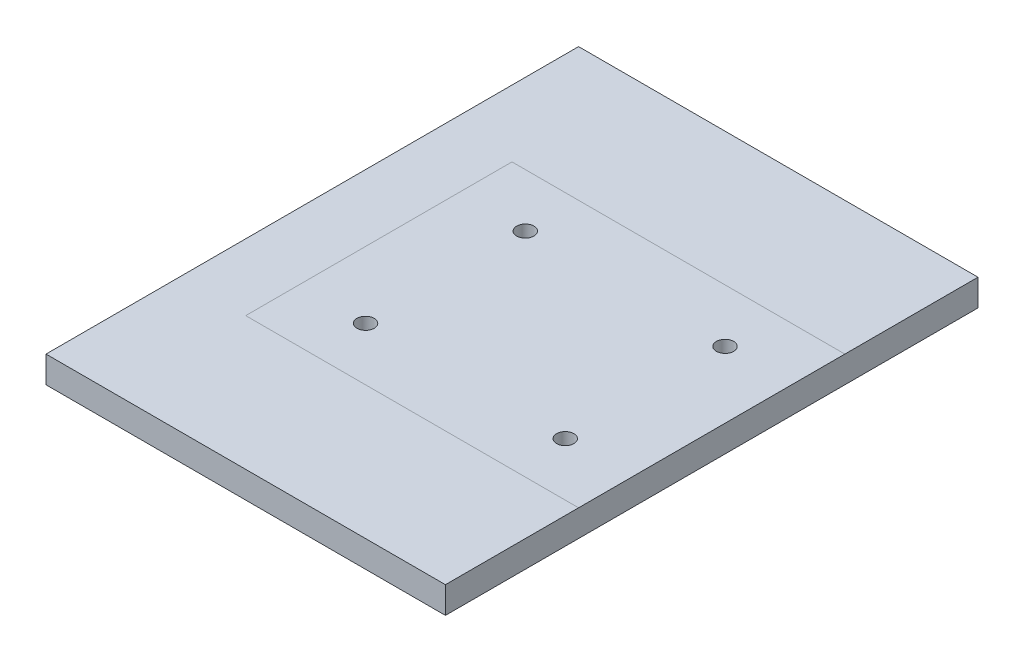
ISO-10303-21;
HEADER;
FILE_DESCRIPTION(('STEP AP214'),'2;1');
FILE_NAME('part.step','',(''),(''),'','','');
FILE_SCHEMA(('AUTOMOTIVE_DESIGN { 1 0 10303 214 1 1 1 1 }'));
ENDSEC;
DATA;
#1=APPLICATION_CONTEXT('core data for automotive mechanical design processes');
#2=APPLICATION_PROTOCOL_DEFINITION('international standard','automotive_design',2000,#1);
#3=PRODUCT_CONTEXT('',#1,'mechanical');
#4=PRODUCT('Part','Part','',(#3));
#5=PRODUCT_RELATED_PRODUCT_CATEGORY('part','',(#4));
#6=PRODUCT_DEFINITION_FORMATION('','',#4);
#7=PRODUCT_DEFINITION_CONTEXT('part definition',#1,'design');
#8=PRODUCT_DEFINITION('design','',#6,#7);
#9=PRODUCT_DEFINITION_SHAPE('','',#8);
#10=(LENGTH_UNIT() NAMED_UNIT(*) SI_UNIT(.MILLI.,.METRE.));
#11=(NAMED_UNIT(*) PLANE_ANGLE_UNIT() SI_UNIT($,.RADIAN.));
#12=(NAMED_UNIT(*) SI_UNIT($,.STERADIAN.) SOLID_ANGLE_UNIT());
#13=UNCERTAINTY_MEASURE_WITH_UNIT(LENGTH_MEASURE(1.E-05),#10,'distance_accuracy_value','');
#14=(GEOMETRIC_REPRESENTATION_CONTEXT(3) GLOBAL_UNCERTAINTY_ASSIGNED_CONTEXT((#13)) GLOBAL_UNIT_ASSIGNED_CONTEXT((#10,
#11,#12)) REPRESENTATION_CONTEXT('',''));
#15=CARTESIAN_POINT('',(0.,0.,0.));
#16=DIRECTION('',(0.,0.,1.));
#17=DIRECTION('',(1.,0.,0.));
#18=AXIS2_PLACEMENT_3D('',#15,#16,#17);
#19=CARTESIAN_POINT('',(-150.,-20.,200.));
#20=DIRECTION('',(0.,1.,0.));
#21=DIRECTION('',(0.,0.,1.));
#22=AXIS2_PLACEMENT_3D('',#19,#20,#21);
#23=PLANE('',#22);
#24=CARTESIAN_POINT('',(-50.,-20.,-60.));
#25=DIRECTION('',(0.,1.,0.));
#26=DIRECTION('',(0.,0.,1.));
#27=AXIS2_PLACEMENT_3D('',#24,#25,#26);
#28=CIRCLE('',#27,14.);
#29=CARTESIAN_POINT('',(-50.,-20.,-46.));
#30=VERTEX_POINT('',#29);
#31=EDGE_CURVE('E42',#30,#30,#28,.F.);
#32=ORIENTED_EDGE('',*,*,#31,.F.);
#33=EDGE_LOOP('',(#32));
#34=FACE_BOUND('',#33,.T.);
#35=CARTESIAN_POINT('',(-50.,-20.,60.));
#36=DIRECTION('',(0.,1.,0.));
#37=DIRECTION('',(0.,0.,1.));
#38=AXIS2_PLACEMENT_3D('',#35,#36,#37);
#39=CIRCLE('',#38,14.);
#40=CARTESIAN_POINT('',(-50.,-20.,74.));
#41=VERTEX_POINT('',#40);
#42=EDGE_CURVE('E141',#41,#41,#39,.F.);
#43=ORIENTED_EDGE('',*,*,#42,.F.);
#44=EDGE_LOOP('',(#43));
#45=FACE_BOUND('',#44,.T.);
#46=DIRECTION('',(0.,0.,1.));
#47=VECTOR('',#46,1.);
#48=CARTESIAN_POINT('',(-150.,-20.,-200.));
#49=LINE('',#48,#47);
#50=CARTESIAN_POINT('',(-150.,-20.,-200.));
#51=VERTEX_POINT('',#50);
#52=CARTESIAN_POINT('',(-150.,-20.,200.));
#53=VERTEX_POINT('',#52);
#54=EDGE_CURVE('E91',#51,#53,#49,.T.);
#55=ORIENTED_EDGE('',*,*,#54,.F.);
#56=DIRECTION('',(-1.,0.,0.));
#57=VECTOR('',#56,1.);
#58=CARTESIAN_POINT('',(-150.,-20.,-200.));
#59=LINE('',#58,#57);
#60=CARTESIAN_POINT('',(150.,-20.,-200.));
#61=VERTEX_POINT('',#60);
#62=EDGE_CURVE('E96',#61,#51,#59,.T.);
#63=ORIENTED_EDGE('',*,*,#62,.F.);
#64=DIRECTION('',(0.,0.,-1.));
#65=VECTOR('',#64,1.);
#66=CARTESIAN_POINT('',(150.,-20.,-200.));
#67=LINE('',#66,#65);
#68=CARTESIAN_POINT('',(150.,-20.,200.));
#69=VERTEX_POINT('',#68);
#70=EDGE_CURVE('E123',#69,#61,#67,.T.);
#71=ORIENTED_EDGE('',*,*,#70,.F.);
#72=DIRECTION('',(1.,0.,0.));
#73=VECTOR('',#72,1.);
#74=CARTESIAN_POINT('',(-150.,-20.,200.));
#75=LINE('',#74,#73);
#76=EDGE_CURVE('E121',#53,#69,#75,.T.);
#77=ORIENTED_EDGE('',*,*,#76,.F.);
#78=EDGE_LOOP('',(#55,#63,#71,#77));
#79=FACE_BOUND('',#78,.T.);
#80=CARTESIAN_POINT('',(100.,-20.,60.));
#81=DIRECTION('',(0.,1.,0.));
#82=DIRECTION('',(0.,0.,1.));
#83=AXIS2_PLACEMENT_3D('',#80,#81,#82);
#84=CIRCLE('',#83,14.);
#85=CARTESIAN_POINT('',(100.,-20.,74.));
#86=VERTEX_POINT('',#85);
#87=EDGE_CURVE('E145',#86,#86,#84,.F.);
#88=ORIENTED_EDGE('',*,*,#87,.F.);
#89=EDGE_LOOP('',(#88));
#90=FACE_BOUND('',#89,.T.);
#91=CARTESIAN_POINT('',(100.,-20.,-60.));
#92=DIRECTION('',(0.,1.,0.));
#93=DIRECTION('',(0.,0.,1.));
#94=AXIS2_PLACEMENT_3D('',#91,#92,#93);
#95=CIRCLE('',#94,14.);
#96=CARTESIAN_POINT('',(100.,-20.,-46.));
#97=VERTEX_POINT('',#96);
#98=EDGE_CURVE('E11',#97,#97,#95,.F.);
#99=ORIENTED_EDGE('',*,*,#98,.F.);
#100=EDGE_LOOP('',(#99));
#101=FACE_BOUND('',#100,.T.);
#102=ADVANCED_FACE('F33',(#34,#45,#79,#90,#101),#23,.F.);
#103=ORIENTED_EDGE('',*,*,#98,.T.);
#104=EDGE_LOOP('',(#103));
#105=FACE_BOUND('',#104,.T.);
#106=CARTESIAN_POINT('',(100.,-20.,-60.));
#107=DIRECTION('',(0.,1.,0.));
#108=DIRECTION('',(0.,0.,1.));
#109=AXIS2_PLACEMENT_3D('',#106,#107,#108);
#110=CIRCLE('',#109,6.5);
#111=CARTESIAN_POINT('',(100.,-20.,-53.5));
#112=VERTEX_POINT('',#111);
#113=EDGE_CURVE('E109',#112,#112,#110,.T.);
#114=ORIENTED_EDGE('',*,*,#113,.T.);
#115=EDGE_LOOP('',(#114));
#116=FACE_BOUND('',#115,.T.);
#117=ADVANCED_FACE('F159',(#105,#116),#23,.F.);
#118=ORIENTED_EDGE('',*,*,#31,.T.);
#119=EDGE_LOOP('',(#118));
#120=FACE_BOUND('',#119,.T.);
#121=CARTESIAN_POINT('',(-50.,-20.,-60.));
#122=DIRECTION('',(0.,1.,0.));
#123=DIRECTION('',(0.,0.,1.));
#124=AXIS2_PLACEMENT_3D('',#121,#122,#123);
#125=CIRCLE('',#124,6.5);
#126=CARTESIAN_POINT('',(-50.,-20.,-53.5));
#127=VERTEX_POINT('',#126);
#128=EDGE_CURVE('E183',#127,#127,#125,.T.);
#129=ORIENTED_EDGE('',*,*,#128,.T.);
#130=EDGE_LOOP('',(#129));
#131=FACE_BOUND('',#130,.T.);
#132=ADVANCED_FACE('F154',(#120,#131),#23,.F.);
#133=ORIENTED_EDGE('',*,*,#87,.T.);
#134=EDGE_LOOP('',(#133));
#135=FACE_BOUND('',#134,.T.);
#136=CARTESIAN_POINT('',(100.,-20.,60.));
#137=DIRECTION('',(0.,1.,0.));
#138=DIRECTION('',(0.,0.,1.));
#139=AXIS2_PLACEMENT_3D('',#136,#137,#138);
#140=CIRCLE('',#139,6.5);
#141=CARTESIAN_POINT('',(100.,-20.,66.5));
#142=VERTEX_POINT('',#141);
#143=EDGE_CURVE('E196',#142,#142,#140,.T.);
#144=ORIENTED_EDGE('',*,*,#143,.T.);
#145=EDGE_LOOP('',(#144));
#146=FACE_BOUND('',#145,.T.);
#147=ADVANCED_FACE('F226',(#135,#146),#23,.F.);
#148=CARTESIAN_POINT('',(-150.,0.,200.));
#149=DIRECTION('',(0.,1.,0.));
#150=DIRECTION('',(0.,0.,1.));
#151=AXIS2_PLACEMENT_3D('',#148,#149,#150);
#152=PLANE('',#151);
#153=DIRECTION('',(0.,0.,-1.));
#154=VECTOR('',#153,1.);
#155=CARTESIAN_POINT('',(-99.9999999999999,0.,200.));
#156=LINE('',#155,#154);
#157=CARTESIAN_POINT('',(-99.9999999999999,0.,100.));
#158=VERTEX_POINT('',#157);
#159=CARTESIAN_POINT('',(-99.9999999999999,0.,-100.));
#160=VERTEX_POINT('',#159);
#161=EDGE_CURVE('E53',#158,#160,#156,.T.);
#162=ORIENTED_EDGE('',*,*,#161,.T.);
#163=DIRECTION('',(1.,0.,0.));
#164=VECTOR('',#163,1.);
#165=CARTESIAN_POINT('',(-150.,0.,-100.));
#166=LINE('',#165,#164);
#167=CARTESIAN_POINT('',(150.,0.,-100.));
#168=VERTEX_POINT('',#167);
#169=EDGE_CURVE('E49',#160,#168,#166,.T.);
#170=ORIENTED_EDGE('',*,*,#169,.T.);
#171=DIRECTION('',(0.,0.,-1.));
#172=VECTOR('',#171,1.);
#173=CARTESIAN_POINT('',(150.,0.,-200.));
#174=LINE('',#173,#172);
#175=CARTESIAN_POINT('',(150.,0.,-200.));
#176=VERTEX_POINT('',#175);
#177=EDGE_CURVE('E104',#168,#176,#174,.T.);
#178=ORIENTED_EDGE('',*,*,#177,.T.);
#179=DIRECTION('',(-1.,0.,0.));
#180=VECTOR('',#179,1.);
#181=CARTESIAN_POINT('',(-150.,0.,-200.));
#182=LINE('',#181,#180);
#183=CARTESIAN_POINT('',(-150.,0.,-200.));
#184=VERTEX_POINT('',#183);
#185=EDGE_CURVE('E108',#176,#184,#182,.T.);
#186=ORIENTED_EDGE('',*,*,#185,.T.);
#187=DIRECTION('',(0.,0.,1.));
#188=VECTOR('',#187,1.);
#189=CARTESIAN_POINT('',(-150.,0.,-200.));
#190=LINE('',#189,#188);
#191=CARTESIAN_POINT('',(-150.,0.,200.));
#192=VERTEX_POINT('',#191);
#193=EDGE_CURVE('E88',#184,#192,#190,.T.);
#194=ORIENTED_EDGE('',*,*,#193,.T.);
#195=DIRECTION('',(1.,0.,0.));
#196=VECTOR('',#195,1.);
#197=CARTESIAN_POINT('',(-150.,0.,200.));
#198=LINE('',#197,#196);
#199=CARTESIAN_POINT('',(150.,0.,200.));
#200=VERTEX_POINT('',#199);
#201=EDGE_CURVE('E99',#192,#200,#198,.T.);
#202=ORIENTED_EDGE('',*,*,#201,.T.);
#203=CARTESIAN_POINT('',(150.,0.,100.));
#204=VERTEX_POINT('',#203);
#205=EDGE_CURVE('E116',#200,#204,#174,.T.);
#206=ORIENTED_EDGE('',*,*,#205,.T.);
#207=DIRECTION('',(-1.,0.,0.));
#208=VECTOR('',#207,1.);
#209=CARTESIAN_POINT('',(-150.,0.,100.));
#210=LINE('',#209,#208);
#211=EDGE_CURVE('E130',#204,#158,#210,.T.);
#212=ORIENTED_EDGE('',*,*,#211,.T.);
#213=EDGE_LOOP('',(#162,#170,#178,#186,#194,#202,#206,#212));
#214=FACE_BOUND('',#213,.T.);
#215=ADVANCED_FACE('F106',(#214),#152,.T.);
#216=CARTESIAN_POINT('',(-150.,-20.,-200.));
#217=DIRECTION('',(-1.,0.,0.));
#218=DIRECTION('',(0.,0.,1.));
#219=AXIS2_PLACEMENT_3D('',#216,#217,#218);
#220=PLANE('',#219);
#221=ORIENTED_EDGE('',*,*,#193,.F.);
#222=DIRECTION('',(0.,1.,0.));
#223=VECTOR('',#222,1.);
#224=CARTESIAN_POINT('',(-150.,-20.,-200.));
#225=LINE('',#224,#223);
#226=EDGE_CURVE('E128',#51,#184,#225,.T.);
#227=ORIENTED_EDGE('',*,*,#226,.F.);
#228=ORIENTED_EDGE('',*,*,#54,.T.);
#229=DIRECTION('',(0.,1.,0.));
#230=VECTOR('',#229,1.);
#231=CARTESIAN_POINT('',(-150.,-20.,200.));
#232=LINE('',#231,#230);
#233=EDGE_CURVE('E85',#53,#192,#232,.T.);
#234=ORIENTED_EDGE('',*,*,#233,.T.);
#235=EDGE_LOOP('',(#221,#227,#228,#234));
#236=FACE_BOUND('',#235,.T.);
#237=ADVANCED_FACE('F35',(#236),#220,.T.);
#238=CARTESIAN_POINT('',(-150.,-20.,-200.));
#239=DIRECTION('',(0.,0.,-1.));
#240=DIRECTION('',(-1.,0.,0.));
#241=AXIS2_PLACEMENT_3D('',#238,#239,#240);
#242=PLANE('',#241);
#243=ORIENTED_EDGE('',*,*,#185,.F.);
#244=DIRECTION('',(0.,1.,0.));
#245=VECTOR('',#244,1.);
#246=CARTESIAN_POINT('',(150.,-20.,-200.));
#247=LINE('',#246,#245);
#248=EDGE_CURVE('E131',#61,#176,#247,.T.);
#249=ORIENTED_EDGE('',*,*,#248,.F.);
#250=ORIENTED_EDGE('',*,*,#62,.T.);
#251=ORIENTED_EDGE('',*,*,#226,.T.);
#252=EDGE_LOOP('',(#243,#249,#250,#251));
#253=FACE_BOUND('',#252,.T.);
#254=ADVANCED_FACE('F227',(#253),#242,.T.);
#255=CARTESIAN_POINT('',(150.,-20.,-200.));
#256=DIRECTION('',(1.,0.,0.));
#257=DIRECTION('',(0.,0.,-1.));
#258=AXIS2_PLACEMENT_3D('',#255,#256,#257);
#259=PLANE('',#258);
#260=ORIENTED_EDGE('',*,*,#205,.F.);
#261=DIRECTION('',(0.,1.,0.));
#262=VECTOR('',#261,1.);
#263=CARTESIAN_POINT('',(150.,-20.,200.));
#264=LINE('',#263,#262);
#265=EDGE_CURVE('E95',#69,#200,#264,.T.);
#266=ORIENTED_EDGE('',*,*,#265,.F.);
#267=ORIENTED_EDGE('',*,*,#70,.T.);
#268=ORIENTED_EDGE('',*,*,#248,.T.);
#269=ORIENTED_EDGE('',*,*,#177,.F.);
#270=EDGE_CURVE('E118',#204,#168,#174,.T.);
#271=ORIENTED_EDGE('',*,*,#270,.F.);
#272=EDGE_LOOP('',(#260,#266,#267,#268,#269,#271));
#273=FACE_BOUND('',#272,.T.);
#274=ADVANCED_FACE('F230',(#273),#259,.T.);
#275=CARTESIAN_POINT('',(-150.,-20.,200.));
#276=DIRECTION('',(0.,0.,1.));
#277=DIRECTION('',(1.,0.,0.));
#278=AXIS2_PLACEMENT_3D('',#275,#276,#277);
#279=PLANE('',#278);
#280=ORIENTED_EDGE('',*,*,#201,.F.);
#281=ORIENTED_EDGE('',*,*,#233,.F.);
#282=ORIENTED_EDGE('',*,*,#76,.T.);
#283=ORIENTED_EDGE('',*,*,#265,.T.);
#284=EDGE_LOOP('',(#280,#281,#282,#283));
#285=FACE_BOUND('',#284,.T.);
#286=ADVANCED_FACE('F100',(#285),#279,.T.);
#287=ORIENTED_EDGE('',*,*,#42,.T.);
#288=EDGE_LOOP('',(#287));
#289=FACE_BOUND('',#288,.T.);
#290=CARTESIAN_POINT('',(-50.,-20.,60.));
#291=DIRECTION('',(0.,1.,0.));
#292=DIRECTION('',(0.,0.,1.));
#293=AXIS2_PLACEMENT_3D('',#290,#291,#292);
#294=CIRCLE('',#293,6.5);
#295=CARTESIAN_POINT('',(-50.,-20.,66.5));
#296=VERTEX_POINT('',#295);
#297=EDGE_CURVE('E190',#296,#296,#294,.T.);
#298=ORIENTED_EDGE('',*,*,#297,.T.);
#299=EDGE_LOOP('',(#298));
#300=FACE_BOUND('',#299,.T.);
#301=ADVANCED_FACE('F161',(#289,#300),#23,.F.);
#302=ORIENTED_EDGE('',*,*,#169,.F.);
#303=ORIENTED_EDGE('',*,*,#161,.F.);
#304=ORIENTED_EDGE('',*,*,#211,.F.);
#305=ORIENTED_EDGE('',*,*,#270,.T.);
#306=EDGE_LOOP('',(#302,#303,#304,#305));
#307=FACE_BOUND('',#306,.T.);
#308=CARTESIAN_POINT('',(100.,0.,60.));
#309=DIRECTION('',(0.,1.,0.));
#310=DIRECTION('',(0.,0.,1.));
#311=AXIS2_PLACEMENT_3D('',#308,#309,#310);
#312=CIRCLE('',#311,6.5);
#313=CARTESIAN_POINT('',(100.,0.,66.5));
#314=VERTEX_POINT('',#313);
#315=EDGE_CURVE('E199',#314,#314,#312,.T.);
#316=ORIENTED_EDGE('',*,*,#315,.F.);
#317=EDGE_LOOP('',(#316));
#318=FACE_BOUND('',#317,.T.);
#319=CARTESIAN_POINT('',(-50.,0.,60.));
#320=DIRECTION('',(0.,1.,0.));
#321=DIRECTION('',(0.,0.,1.));
#322=AXIS2_PLACEMENT_3D('',#319,#320,#321);
#323=CIRCLE('',#322,6.5);
#324=CARTESIAN_POINT('',(-50.,0.,66.5));
#325=VERTEX_POINT('',#324);
#326=EDGE_CURVE('E193',#325,#325,#323,.T.);
#327=ORIENTED_EDGE('',*,*,#326,.F.);
#328=EDGE_LOOP('',(#327));
#329=FACE_BOUND('',#328,.T.);
#330=CARTESIAN_POINT('',(-50.,0.,-60.));
#331=DIRECTION('',(0.,1.,0.));
#332=DIRECTION('',(0.,0.,1.));
#333=AXIS2_PLACEMENT_3D('',#330,#331,#332);
#334=CIRCLE('',#333,6.5);
#335=CARTESIAN_POINT('',(-50.,0.,-53.5));
#336=VERTEX_POINT('',#335);
#337=EDGE_CURVE('E185',#336,#336,#334,.T.);
#338=ORIENTED_EDGE('',*,*,#337,.F.);
#339=EDGE_LOOP('',(#338));
#340=FACE_BOUND('',#339,.T.);
#341=CARTESIAN_POINT('',(100.,0.,-60.));
#342=DIRECTION('',(0.,1.,0.));
#343=DIRECTION('',(0.,0.,1.));
#344=AXIS2_PLACEMENT_3D('',#341,#342,#343);
#345=CIRCLE('',#344,6.5);
#346=CARTESIAN_POINT('',(100.,0.,-53.5));
#347=VERTEX_POINT('',#346);
#348=EDGE_CURVE('E112',#347,#347,#345,.T.);
#349=ORIENTED_EDGE('',*,*,#348,.F.);
#350=EDGE_LOOP('',(#349));
#351=FACE_BOUND('',#350,.T.);
#352=ADVANCED_FACE('F178',(#307,#318,#329,#340,#351),#152,.T.);
#353=CARTESIAN_POINT('',(100.,-20.,-60.));
#354=DIRECTION('',(0.,1.,0.));
#355=DIRECTION('',(0.,0.,1.));
#356=AXIS2_PLACEMENT_3D('',#353,#354,#355);
#357=CYLINDRICAL_SURFACE('',#356,6.5);
#358=ORIENTED_EDGE('',*,*,#113,.F.);
#359=EDGE_LOOP('',(#358));
#360=FACE_BOUND('',#359,.T.);
#361=ORIENTED_EDGE('',*,*,#348,.T.);
#362=EDGE_LOOP('',(#361));
#363=FACE_BOUND('',#362,.T.);
#364=ADVANCED_FACE('F174',(#360,#363),#357,.F.);
#365=CARTESIAN_POINT('',(-50.,-20.,-60.));
#366=DIRECTION('',(0.,1.,0.));
#367=DIRECTION('',(0.,0.,1.));
#368=AXIS2_PLACEMENT_3D('',#365,#366,#367);
#369=CYLINDRICAL_SURFACE('',#368,6.5);
#370=ORIENTED_EDGE('',*,*,#128,.F.);
#371=EDGE_LOOP('',(#370));
#372=FACE_BOUND('',#371,.T.);
#373=ORIENTED_EDGE('',*,*,#337,.T.);
#374=EDGE_LOOP('',(#373));
#375=FACE_BOUND('',#374,.T.);
#376=ADVANCED_FACE('F177',(#372,#375),#369,.F.);
#377=CARTESIAN_POINT('',(-50.,-20.,60.));
#378=DIRECTION('',(0.,1.,0.));
#379=DIRECTION('',(0.,0.,1.));
#380=AXIS2_PLACEMENT_3D('',#377,#378,#379);
#381=CYLINDRICAL_SURFACE('',#380,6.5);
#382=ORIENTED_EDGE('',*,*,#297,.F.);
#383=EDGE_LOOP('',(#382));
#384=FACE_BOUND('',#383,.T.);
#385=ORIENTED_EDGE('',*,*,#326,.T.);
#386=EDGE_LOOP('',(#385));
#387=FACE_BOUND('',#386,.T.);
#388=ADVANCED_FACE('F213',(#384,#387),#381,.F.);
#389=CARTESIAN_POINT('',(100.,-20.,60.));
#390=DIRECTION('',(0.,1.,0.));
#391=DIRECTION('',(0.,0.,1.));
#392=AXIS2_PLACEMENT_3D('',#389,#390,#391);
#393=CYLINDRICAL_SURFACE('',#392,6.5);
#394=ORIENTED_EDGE('',*,*,#143,.F.);
#395=EDGE_LOOP('',(#394));
#396=FACE_BOUND('',#395,.T.);
#397=ORIENTED_EDGE('',*,*,#315,.T.);
#398=EDGE_LOOP('',(#397));
#399=FACE_BOUND('',#398,.T.);
#400=ADVANCED_FACE('F203',(#396,#399),#393,.F.);
#401=CLOSED_SHELL('',(#102,#117,#132,#147,#215,#237,#254,#274,#286,#301,#352,#364,#376,#388,#400));
#402=MANIFOLD_SOLID_BREP('B2',#401);
#403=ADVANCED_BREP_SHAPE_REPRESENTATION('',(#18,#402),#14);
#404=SHAPE_DEFINITION_REPRESENTATION(#9,#403);
ENDSEC;
END-ISO-10303-21;
